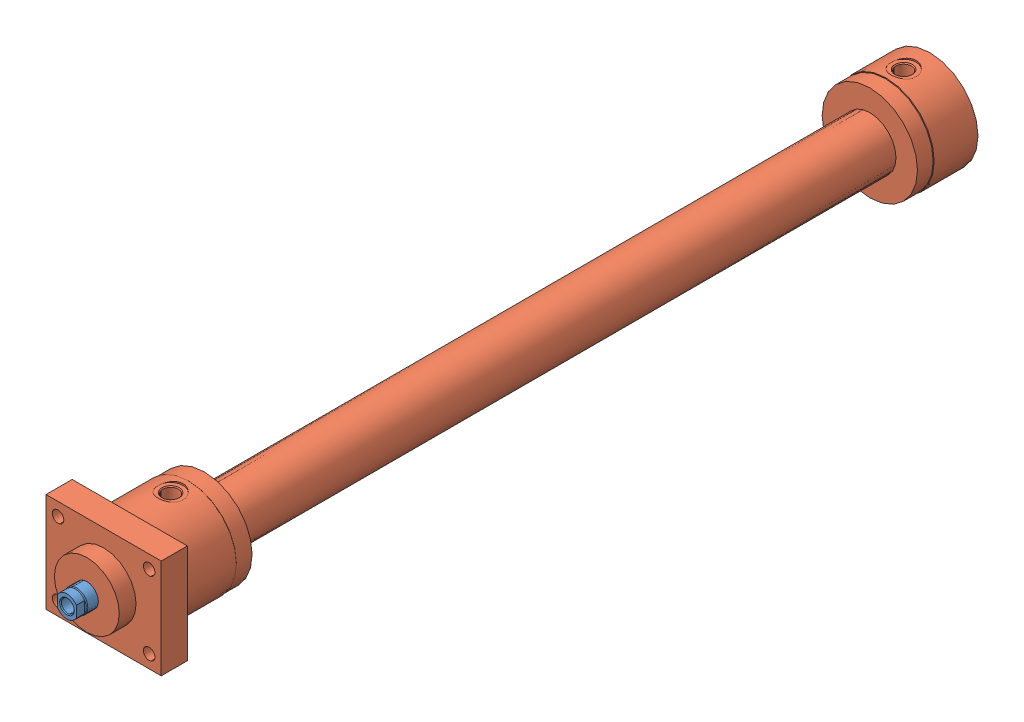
SolidWorks assembly cylinder_vfa_40_mf1_s_2_n_600_l1_0.SLDASM, configuration Default (file format 8000). Lengths in mm.
Overall size (110 95 824).
2 component instances, 2 part files, 0 mates.
Components (placement in the parent):
- cylinder_vfa_40_mf1_s_2_n_600_l1_0_01-1: cylinder_vfa_40_mf1_s_2_n_600_l1_0_01.SLDPRT [Default] at origin size (40 40 754)
- cylinder_vfa_40_mf1_s_2_n_600_l1_0_02-1: cylinder_vfa_40_mf1_s_2_n_600_l1_0_02.SLDPRT [Default] at origin size (110 95 805)
